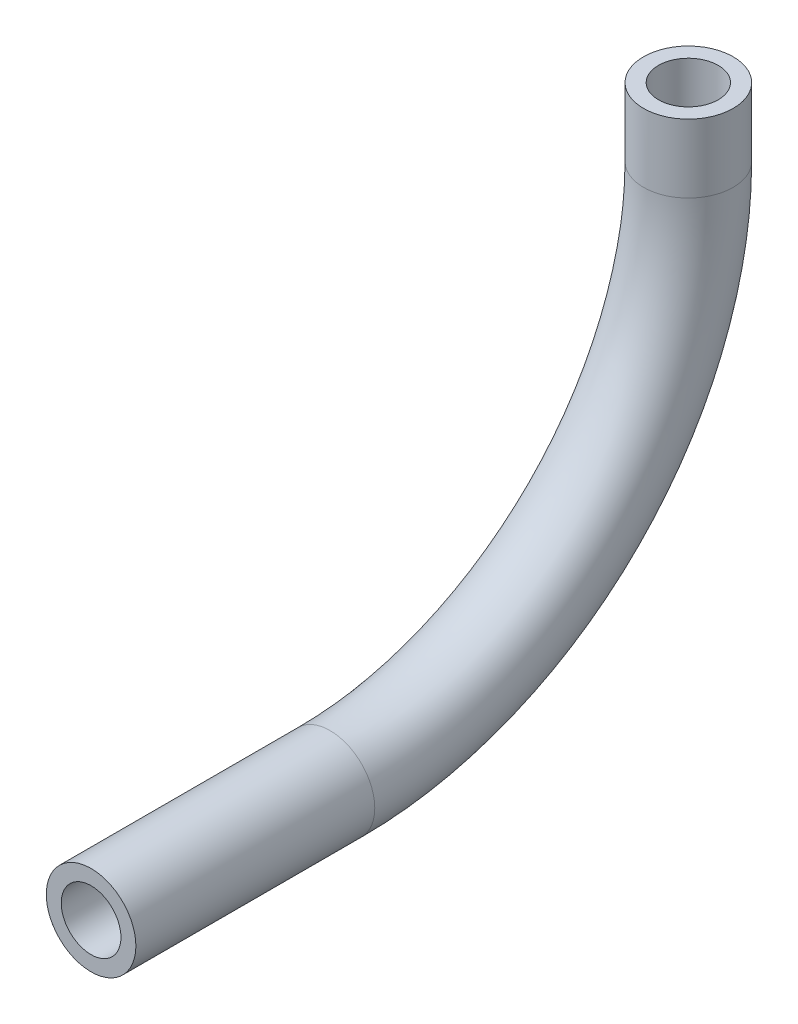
from build123d import *

# Parameters (mm, degrees)
SKETCH1_R   = 9.525
SKETCH1_R_2 = 6.35


with BuildPart() as part:
    # Sweep1: sweep along a path in Sketch2
    with BuildLine(Plane(origin=(0, 0, 0), x_dir=(0, 0, -1), z_dir=(1, 0, 0))) as sweep1_path:
        Line((0, 0), (50.8, 0))
        ThreePointArc((50.8, 0), (104.681536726, 22.318463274), (127, 76.2))
        Line((127, 76.2), (127, 90.740409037))
    # Sketch1 → Sweep1 (sweep)
    with BuildSketch(Plane.XY):
        Circle(SKETCH1_R)
        Circle(SKETCH1_R_2, mode=Mode.SUBTRACT)
    sweep(path=sweep1_path.line)


solid = part.part
